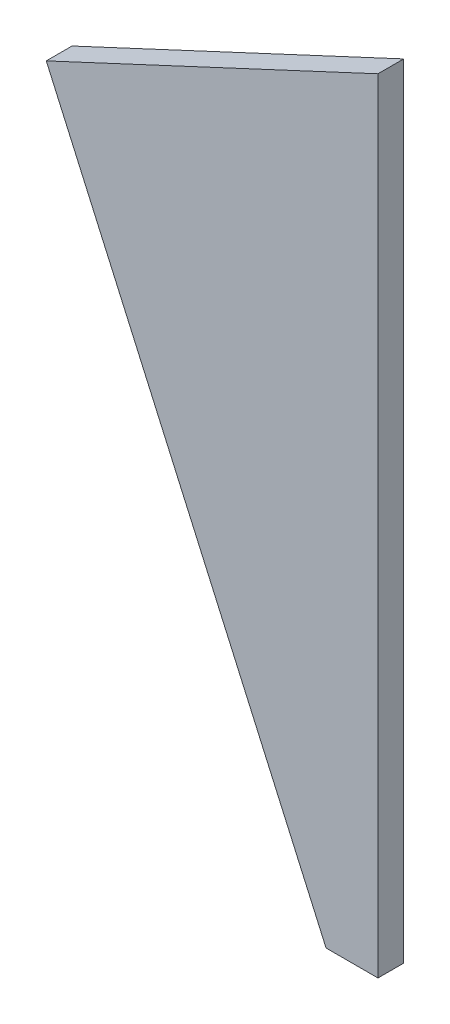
ISO-10303-21;
HEADER;
FILE_DESCRIPTION(('STEP AP214'),'2;1');
FILE_NAME('part.step','',(''),(''),'','','');
FILE_SCHEMA(('AUTOMOTIVE_DESIGN { 1 0 10303 214 1 1 1 1 }'));
ENDSEC;
DATA;
#1=APPLICATION_CONTEXT('core data for automotive mechanical design processes');
#2=APPLICATION_PROTOCOL_DEFINITION('international standard','automotive_design',2000,#1);
#3=PRODUCT_CONTEXT('',#1,'mechanical');
#4=PRODUCT('Part','Part','',(#3));
#5=PRODUCT_RELATED_PRODUCT_CATEGORY('part','',(#4));
#6=PRODUCT_DEFINITION_FORMATION('','',#4);
#7=PRODUCT_DEFINITION_CONTEXT('part definition',#1,'design');
#8=PRODUCT_DEFINITION('design','',#6,#7);
#9=PRODUCT_DEFINITION_SHAPE('','',#8);
#10=(LENGTH_UNIT() NAMED_UNIT(*) SI_UNIT(.MILLI.,.METRE.));
#11=(NAMED_UNIT(*) PLANE_ANGLE_UNIT() SI_UNIT($,.RADIAN.));
#12=(NAMED_UNIT(*) SI_UNIT($,.STERADIAN.) SOLID_ANGLE_UNIT());
#13=UNCERTAINTY_MEASURE_WITH_UNIT(LENGTH_MEASURE(1.E-05),#10,'distance_accuracy_value','');
#14=(GEOMETRIC_REPRESENTATION_CONTEXT(3) GLOBAL_UNCERTAINTY_ASSIGNED_CONTEXT((#13)) GLOBAL_UNIT_ASSIGNED_CONTEXT((#10,
#11,#12)) REPRESENTATION_CONTEXT('',''));
#15=CARTESIAN_POINT('',(0.,0.,0.));
#16=DIRECTION('',(0.,0.,1.));
#17=DIRECTION('',(1.,0.,0.));
#18=AXIS2_PLACEMENT_3D('',#15,#16,#17);
#19=CARTESIAN_POINT('',(0.,111.068845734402,-3.175));
#20=DIRECTION('',(-0.422618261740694,0.906307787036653,0.));
#21=DIRECTION('',(-0.906307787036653,-0.422618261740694,0.));
#22=AXIS2_PLACEMENT_3D('',#19,#20,#21);
#23=PLANE('',#22);
#24=DIRECTION('',(-0.906307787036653,-0.422618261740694,0.));
#25=VECTOR('',#24,1.);
#26=CARTESIAN_POINT('',(0.,111.068845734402,0.));
#27=LINE('',#26,#25);
#28=CARTESIAN_POINT('',(0.,111.068845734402,0.));
#29=VERTEX_POINT('',#28);
#30=CARTESIAN_POINT('',(-40.8825807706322,92.0049852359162,0.));
#31=VERTEX_POINT('',#30);
#32=EDGE_CURVE('E99',#29,#31,#27,.T.);
#33=ORIENTED_EDGE('',*,*,#32,.F.);
#34=DIRECTION('',(0.,0.,1.));
#35=VECTOR('',#34,1.);
#36=CARTESIAN_POINT('',(0.,111.068845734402,-3.175));
#37=LINE('',#36,#35);
#38=CARTESIAN_POINT('',(0.,111.068845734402,-3.175));
#39=VERTEX_POINT('',#38);
#40=EDGE_CURVE('E11',#39,#29,#37,.T.);
#41=ORIENTED_EDGE('',*,*,#40,.F.);
#42=DIRECTION('',(-0.906307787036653,-0.422618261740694,0.));
#43=VECTOR('',#42,1.);
#44=CARTESIAN_POINT('',(0.,111.068845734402,-3.175));
#45=LINE('',#44,#43);
#46=CARTESIAN_POINT('',(-40.8825807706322,92.0049852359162,-3.175));
#47=VERTEX_POINT('',#46);
#48=EDGE_CURVE('E93',#39,#47,#45,.T.);
#49=ORIENTED_EDGE('',*,*,#48,.T.);
#50=DIRECTION('',(0.,0.,1.));
#51=VECTOR('',#50,1.);
#52=CARTESIAN_POINT('',(-40.8825807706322,92.0049852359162,-3.175));
#53=LINE('',#52,#51);
#54=EDGE_CURVE('E38',#47,#31,#53,.T.);
#55=ORIENTED_EDGE('',*,*,#54,.T.);
#56=EDGE_LOOP('',(#33,#41,#49,#55));
#57=FACE_BOUND('',#56,.T.);
#58=ADVANCED_FACE('F35',(#57),#23,.T.);
#59=CARTESIAN_POINT('',(0.,14.548845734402,-3.175));
#60=DIRECTION('',(1.,0.,0.));
#61=DIRECTION('',(0.,1.,0.));
#62=AXIS2_PLACEMENT_3D('',#59,#60,#61);
#63=PLANE('',#62);
#64=DIRECTION('',(0.,1.,0.));
#65=VECTOR('',#64,1.);
#66=CARTESIAN_POINT('',(0.,14.548845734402,0.));
#67=LINE('',#66,#65);
#68=CARTESIAN_POINT('',(0.,14.548845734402,0.));
#69=VERTEX_POINT('',#68);
#70=EDGE_CURVE('E95',#69,#29,#67,.T.);
#71=ORIENTED_EDGE('',*,*,#70,.F.);
#72=DIRECTION('',(0.,0.,1.));
#73=VECTOR('',#72,1.);
#74=CARTESIAN_POINT('',(0.,14.548845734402,-3.175));
#75=LINE('',#74,#73);
#76=CARTESIAN_POINT('',(0.,14.548845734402,-3.175));
#77=VERTEX_POINT('',#76);
#78=EDGE_CURVE('E44',#77,#69,#75,.T.);
#79=ORIENTED_EDGE('',*,*,#78,.F.);
#80=DIRECTION('',(0.,1.,0.));
#81=VECTOR('',#80,1.);
#82=CARTESIAN_POINT('',(0.,14.548845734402,-3.175));
#83=LINE('',#82,#81);
#84=EDGE_CURVE('E90',#77,#39,#83,.T.);
#85=ORIENTED_EDGE('',*,*,#84,.T.);
#86=ORIENTED_EDGE('',*,*,#40,.T.);
#87=EDGE_LOOP('',(#71,#79,#85,#86));
#88=FACE_BOUND('',#87,.T.);
#89=ADVANCED_FACE('F109',(#88),#63,.T.);
#90=CARTESIAN_POINT('',(0.,14.548845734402,-3.175));
#91=DIRECTION('',(0.,-1.,0.));
#92=DIRECTION('',(1.,0.,0.));
#93=AXIS2_PLACEMENT_3D('',#90,#91,#92);
#94=PLANE('',#93);
#95=DIRECTION('',(1.,0.,0.));
#96=VECTOR('',#95,1.);
#97=CARTESIAN_POINT('',(0.,14.548845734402,0.));
#98=LINE('',#97,#96);
#99=CARTESIAN_POINT('',(-6.39688561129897,14.548845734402,0.));
#100=VERTEX_POINT('',#99);
#101=EDGE_CURVE('E85',#100,#69,#98,.T.);
#102=ORIENTED_EDGE('',*,*,#101,.F.);
#103=DIRECTION('',(0.,0.,1.));
#104=VECTOR('',#103,1.);
#105=CARTESIAN_POINT('',(-6.39688561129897,14.548845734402,-3.175));
#106=LINE('',#105,#104);
#107=CARTESIAN_POINT('',(-6.39688561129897,14.548845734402,-3.175));
#108=VERTEX_POINT('',#107);
#109=EDGE_CURVE('E80',#108,#100,#106,.T.);
#110=ORIENTED_EDGE('',*,*,#109,.F.);
#111=DIRECTION('',(1.,0.,0.));
#112=VECTOR('',#111,1.);
#113=CARTESIAN_POINT('',(0.,14.548845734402,-3.175));
#114=LINE('',#113,#112);
#115=EDGE_CURVE('E83',#108,#77,#114,.T.);
#116=ORIENTED_EDGE('',*,*,#115,.T.);
#117=ORIENTED_EDGE('',*,*,#78,.T.);
#118=EDGE_LOOP('',(#102,#110,#116,#117));
#119=FACE_BOUND('',#118,.T.);
#120=ADVANCED_FACE('F82',(#119),#94,.T.);
#121=CARTESIAN_POINT('',(-40.8825807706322,92.0049852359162,-3.175));
#122=DIRECTION('',(-0.913545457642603,-0.406736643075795,0.));
#123=DIRECTION('',(0.406736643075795,-0.913545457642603,0.));
#124=AXIS2_PLACEMENT_3D('',#121,#122,#123);
#125=PLANE('',#124);
#126=DIRECTION('',(0.406736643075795,-0.913545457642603,0.));
#127=VECTOR('',#126,1.);
#128=CARTESIAN_POINT('',(-40.8825807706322,92.0049852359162,0.));
#129=LINE('',#128,#127);
#130=EDGE_CURVE('E102',#31,#100,#129,.T.);
#131=ORIENTED_EDGE('',*,*,#130,.F.);
#132=ORIENTED_EDGE('',*,*,#54,.F.);
#133=DIRECTION('',(0.406736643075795,-0.913545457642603,0.));
#134=VECTOR('',#133,1.);
#135=CARTESIAN_POINT('',(-40.8825807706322,92.0049852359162,-3.175));
#136=LINE('',#135,#134);
#137=EDGE_CURVE('E89',#47,#108,#136,.T.);
#138=ORIENTED_EDGE('',*,*,#137,.T.);
#139=ORIENTED_EDGE('',*,*,#109,.T.);
#140=EDGE_LOOP('',(#131,#132,#138,#139));
#141=FACE_BOUND('',#140,.T.);
#142=ADVANCED_FACE('F92',(#141),#125,.T.);
#143=CARTESIAN_POINT('',(0.,0.,-3.175));
#144=DIRECTION('',(0.,0.,1.));
#145=DIRECTION('',(1.,0.,0.));
#146=AXIS2_PLACEMENT_3D('',#143,#144,#145);
#147=PLANE('',#146);
#148=ORIENTED_EDGE('',*,*,#48,.F.);
#149=ORIENTED_EDGE('',*,*,#84,.F.);
#150=ORIENTED_EDGE('',*,*,#115,.F.);
#151=ORIENTED_EDGE('',*,*,#137,.F.);
#152=EDGE_LOOP('',(#148,#149,#150,#151));
#153=FACE_BOUND('',#152,.T.);
#154=ADVANCED_FACE('F88',(#153),#147,.F.);
#155=CARTESIAN_POINT('',(0.,0.,0.));
#156=DIRECTION('',(0.,0.,1.));
#157=DIRECTION('',(1.,0.,0.));
#158=AXIS2_PLACEMENT_3D('',#155,#156,#157);
#159=PLANE('',#158);
#160=ORIENTED_EDGE('',*,*,#32,.T.);
#161=ORIENTED_EDGE('',*,*,#130,.T.);
#162=ORIENTED_EDGE('',*,*,#101,.T.);
#163=ORIENTED_EDGE('',*,*,#70,.T.);
#164=EDGE_LOOP('',(#160,#161,#162,#163));
#165=FACE_BOUND('',#164,.T.);
#166=ADVANCED_FACE('F108',(#165),#159,.T.);
#167=CLOSED_SHELL('',(#58,#89,#120,#142,#154,#166));
#168=MANIFOLD_SOLID_BREP('B2',#167);
#169=ADVANCED_BREP_SHAPE_REPRESENTATION('',(#18,#168),#14);
#170=SHAPE_DEFINITION_REPRESENTATION(#9,#169);
ENDSEC;
END-ISO-10303-21;
